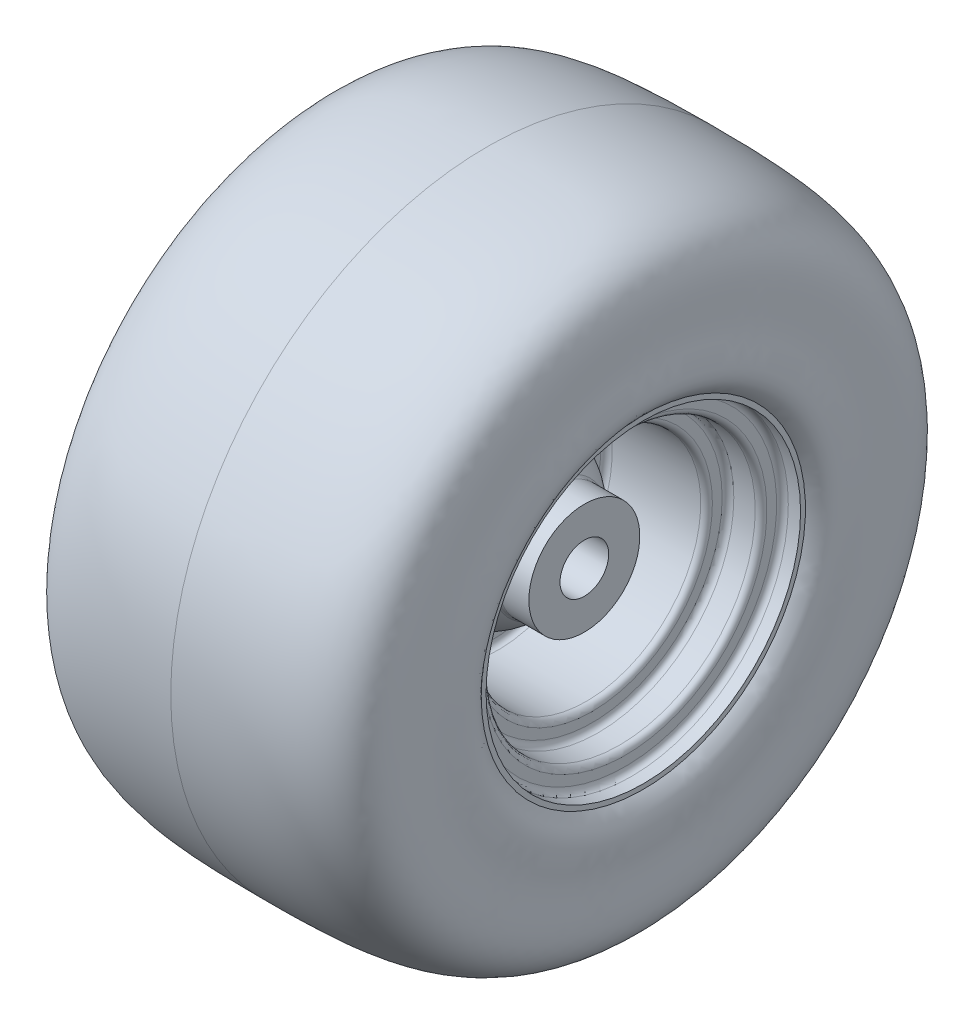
from build123d import *


with BuildPart() as part:
    # Esquisse1 → R_volution1 (revolve)
    with BuildSketch(Plane(origin=(0, 0, 0), x_dir=(1, 0, 0), z_dir=(0, 1, 0)), mode=Mode.PRIVATE) as r_volution1_sk:
        with BuildLine():
            Line((-50, 28.5), (-50, 12.5))
            Line((-50, 12.5), (50, 12.5))
            Line((50, 12.5), (50, 28.5))
            Line((50, 28.5), (34.379502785, 28.5))
            ThreePointArc((34.379502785, 28.5), (33.217367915, 28.734237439), (32.236710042, 29.400371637))
            ThreePointArc((32.236710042, 29.400371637), (19.656108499, 38.970368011), (4.861348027, 44.535565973))
            ThreePointArc((4.861348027, 44.535565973), (3.163768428, 45.584772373), (2.5, 47.46679842))
            Line((2.5, 47.46679842), (2.5, 55.8))
            ThreePointArc((2.5, 55.8), (3.378679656, 57.921320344), (5.5, 58.8))
            Line((5.5, 58.8), (51, 58.8))
            ThreePointArc((51, 58.8), (53.121320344, 59.678679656), (54, 61.8))
            Line((54, 61.8), (54, 66.8))
            ThreePointArc((54, 66.8), (54.878679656, 68.921320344), (57, 69.8))
            Line((57, 69.8), (68, 69.8))
            ThreePointArc((68, 69.8), (70.121320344, 70.678679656), (71, 72.8))
            Line((71, 72.8), (71, 77.8))
            ThreePointArc((71, 77.8), (71.878679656, 79.921320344), (74, 80.8))
            Line((74, 80.8), (80.3, 80.8))
            Line((80.3, 80.8), (80.3, 83.3))
            add(Edge.make_bspline(
                [(80.3, 83.3), (81.791658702, 84.746155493), (88.041182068, 90.805036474), (82.357443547, 111.706032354), (90.974539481, 162.134058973), (38.356748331, 162.345711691), (0, 162.5)],
                knots=[0, 0, 0, 0, 0.041867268, 0.175409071, 0.398898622, 1, 1, 1, 1], degree=3))
            add(Edge.make_bspline(
                [(-80.3, 83.3), (-81.791658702, 84.746155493), (-88.041182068, 90.805036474), (-82.357443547, 111.706032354), (-90.974539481, 162.134058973), (-38.356748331, 162.345711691), (0, 162.5)],
                knots=[0, 0, 0, 0, 0.041867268, 0.175409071, 0.398898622, 1, 1, 1, 1], degree=3))
            Line((-80.3, 83.3), (-80.3, 80.8))
            Line((-80.3, 80.8), (-74, 80.8))
            ThreePointArc((-74, 80.8), (-71.878679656, 79.921320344), (-71, 77.8))
            Line((-71, 77.8), (-71, 72.8))
            ThreePointArc((-71, 72.8), (-70.121320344, 70.678679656), (-68, 69.8))
            Line((-68, 69.8), (-57, 69.8))
            ThreePointArc((-57, 69.8), (-54.878679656, 68.921320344), (-54, 66.8))
            Line((-54, 66.8), (-54, 61.8))
            ThreePointArc((-54, 61.8), (-53.121320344, 59.678679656), (-51, 58.8))
            Line((-51, 58.8), (-5.5, 58.8))
            ThreePointArc((-5.5, 58.8), (-3.378679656, 57.921320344), (-2.5, 55.8))
            Line((-2.5, 55.8), (-2.5, 47.46679842))
            ThreePointArc((-2.5, 47.46679842), (-3.163768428, 45.584772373), (-4.861348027, 44.535565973))
            ThreePointArc((-4.861348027, 44.535565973), (-19.656108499, 38.970368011), (-32.236710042, 29.400371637))
            ThreePointArc((-32.236710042, 29.400371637), (-33.217367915, 28.734237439), (-34.379502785, 28.5))
            Line((-34.379502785, 28.5), (-50, 28.5))
        make_face()
    revolve(r_volution1_sk.sketch.rotate(Axis((-43.352157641, 0, 0), (1, 0, 0)), 180), axis=Axis((-43.352157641, 0, 0), (1, 0, 0)))


solid = part.part
